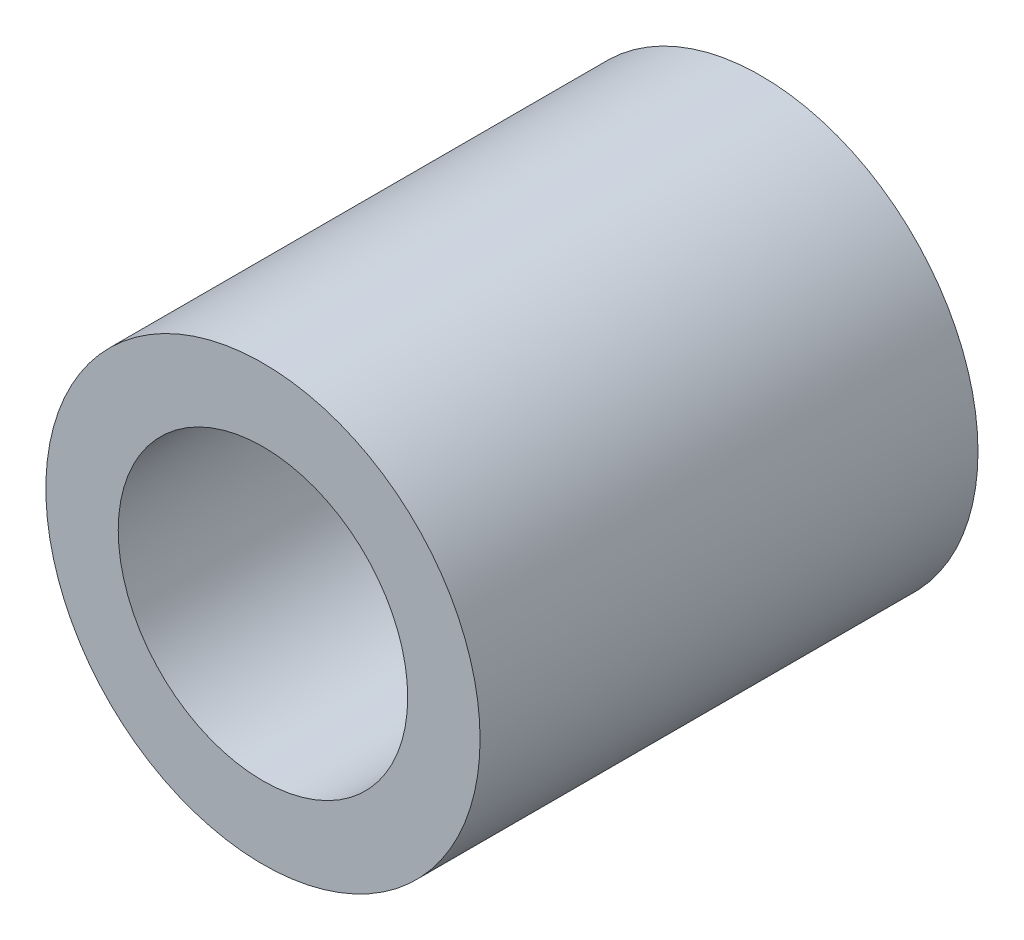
from build123d import *

# Parameters (mm, degrees)
SKETCH1_R           = 4.7625
SKETCH1_R_2         = 3.175
BOSS_EXTRUDE1_DEPTH = 10.922


with BuildPart() as part:
    # Sketch1 → Boss-Extrude1 (new body)
    with BuildSketch(Plane.XY):
        Circle(SKETCH1_R)
        Circle(SKETCH1_R_2, mode=Mode.SUBTRACT)
    extrude(amount=BOSS_EXTRUDE1_DEPTH)


solid = part.part
